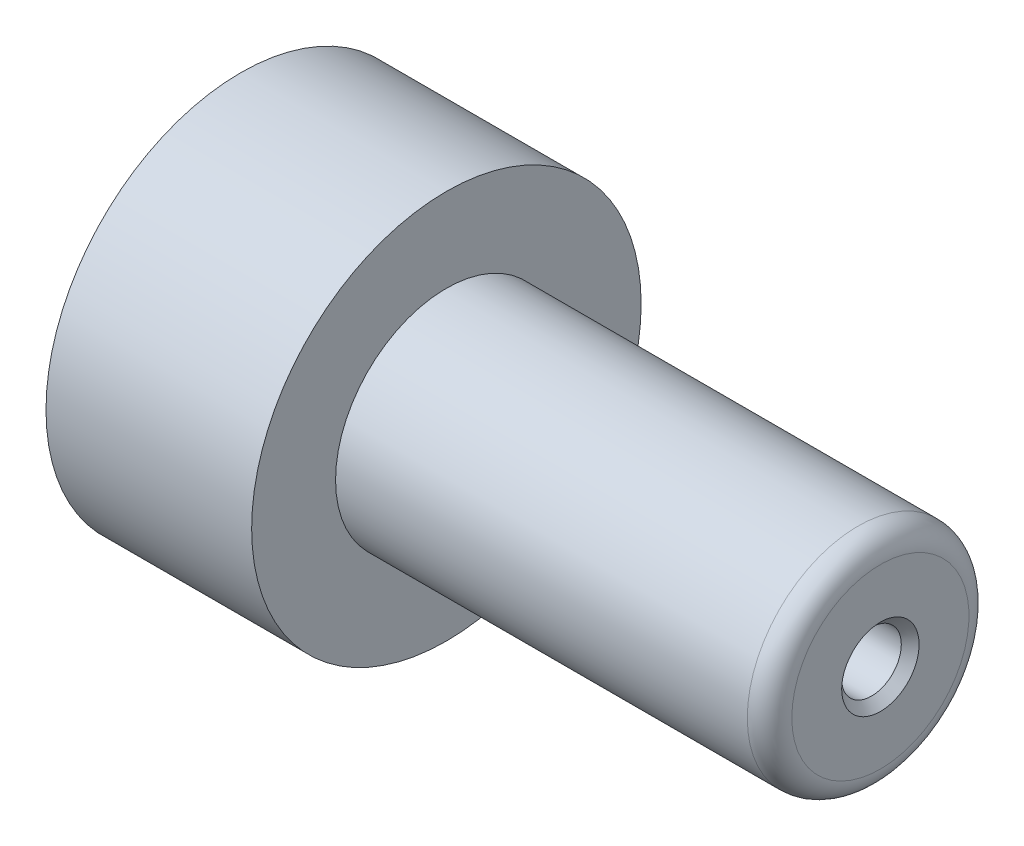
ISO-10303-21;
HEADER;
FILE_DESCRIPTION(('STEP AP214'),'2;1');
FILE_NAME('part.step','',(''),(''),'','','');
FILE_SCHEMA(('AUTOMOTIVE_DESIGN { 1 0 10303 214 1 1 1 1 }'));
ENDSEC;
DATA;
#1=APPLICATION_CONTEXT('core data for automotive mechanical design processes');
#2=APPLICATION_PROTOCOL_DEFINITION('international standard','automotive_design',2000,#1);
#3=PRODUCT_CONTEXT('',#1,'mechanical');
#4=PRODUCT('Part','Part','',(#3));
#5=PRODUCT_RELATED_PRODUCT_CATEGORY('part','',(#4));
#6=PRODUCT_DEFINITION_FORMATION('','',#4);
#7=PRODUCT_DEFINITION_CONTEXT('part definition',#1,'design');
#8=PRODUCT_DEFINITION('design','',#6,#7);
#9=PRODUCT_DEFINITION_SHAPE('','',#8);
#10=(LENGTH_UNIT() NAMED_UNIT(*) SI_UNIT(.MILLI.,.METRE.));
#11=(NAMED_UNIT(*) PLANE_ANGLE_UNIT() SI_UNIT($,.RADIAN.));
#12=(NAMED_UNIT(*) SI_UNIT($,.STERADIAN.) SOLID_ANGLE_UNIT());
#13=UNCERTAINTY_MEASURE_WITH_UNIT(LENGTH_MEASURE(1.E-05),#10,'distance_accuracy_value','');
#14=(GEOMETRIC_REPRESENTATION_CONTEXT(3) GLOBAL_UNCERTAINTY_ASSIGNED_CONTEXT((#13)) GLOBAL_UNIT_ASSIGNED_CONTEXT((#10,
#11,#12)) REPRESENTATION_CONTEXT('',''));
#15=CARTESIAN_POINT('',(0.,0.,0.));
#16=DIRECTION('',(0.,0.,1.));
#17=DIRECTION('',(1.,0.,0.));
#18=AXIS2_PLACEMENT_3D('',#15,#16,#17);
#19=CARTESIAN_POINT('',(0.,0.,0.));
#20=DIRECTION('',(-1.,0.,0.));
#21=DIRECTION('',(0.,0.,1.));
#22=AXIS2_PLACEMENT_3D('',#19,#20,#21);
#23=CYLINDRICAL_SURFACE('',#22,3.9751);
#24=CARTESIAN_POINT('',(21.7678,0.,0.));
#25=DIRECTION('',(-1.,0.,0.));
#26=DIRECTION('',(0.,0.,1.));
#27=AXIS2_PLACEMENT_3D('',#24,#25,#26);
#28=CIRCLE('',#27,3.9751);
#29=CARTESIAN_POINT('',(21.7678,0.,3.9751));
#30=VERTEX_POINT('',#29);
#31=EDGE_CURVE('E44',#30,#30,#28,.T.);
#32=ORIENTED_EDGE('',*,*,#31,.F.);
#33=EDGE_LOOP('',(#32));
#34=FACE_BOUND('',#33,.T.);
#35=CARTESIAN_POINT('',(0.,0.,0.));
#36=DIRECTION('',(-1.,0.,0.));
#37=DIRECTION('',(0.,0.,1.));
#38=AXIS2_PLACEMENT_3D('',#35,#36,#37);
#39=CIRCLE('',#38,3.9751);
#40=CARTESIAN_POINT('',(0.,0.,3.9751));
#41=VERTEX_POINT('',#40);
#42=EDGE_CURVE('E65',#41,#41,#39,.T.);
#43=ORIENTED_EDGE('',*,*,#42,.T.);
#44=EDGE_LOOP('',(#43));
#45=FACE_BOUND('',#44,.T.);
#46=ADVANCED_FACE('F33',(#34,#45),#23,.F.);
#47=CARTESIAN_POINT('',(21.7678,3.9751,0.));
#48=DIRECTION('',(1.,0.,0.));
#49=DIRECTION('',(0.,0.,-1.));
#50=AXIS2_PLACEMENT_3D('',#47,#48,#49);
#51=PLANE('',#50);
#52=ORIENTED_EDGE('',*,*,#31,.T.);
#53=EDGE_LOOP('',(#52));
#54=FACE_BOUND('',#53,.T.);
#55=ADVANCED_FACE('F99',(#54),#51,.F.);
#56=CARTESIAN_POINT('',(36.4998,5.0546,0.));
#57=DIRECTION('',(-1.,0.,0.));
#58=DIRECTION('',(0.,0.,1.));
#59=AXIS2_PLACEMENT_3D('',#56,#57,#58);
#60=PLANE('',#59);
#61=CARTESIAN_POINT('',(36.4998,0.,0.));
#62=DIRECTION('',(-1.,0.,0.));
#63=DIRECTION('',(0.,0.,1.));
#64=AXIS2_PLACEMENT_3D('',#61,#62,#63);
#65=CIRCLE('',#64,2.2098);
#66=CARTESIAN_POINT('',(36.4998,0.,2.2098));
#67=VERTEX_POINT('',#66);
#68=EDGE_CURVE('E10',#67,#67,#65,.T.);
#69=ORIENTED_EDGE('',*,*,#68,.T.);
#70=EDGE_LOOP('',(#69));
#71=FACE_BOUND('',#70,.T.);
#72=CARTESIAN_POINT('',(36.4998,0.,0.));
#73=DIRECTION('',(-1.,0.,0.));
#74=DIRECTION('',(0.,0.,1.));
#75=AXIS2_PLACEMENT_3D('',#72,#73,#74);
#76=CIRCLE('',#75,5.0546);
#77=CARTESIAN_POINT('',(36.4998,0.,5.0546));
#78=VERTEX_POINT('',#77);
#79=EDGE_CURVE('E48',#78,#78,#76,.T.);
#80=ORIENTED_EDGE('',*,*,#79,.F.);
#81=EDGE_LOOP('',(#80));
#82=FACE_BOUND('',#81,.T.);
#83=ADVANCED_FACE('F104',(#71,#82),#60,.F.);
#84=CARTESIAN_POINT('',(35.2298,0.,0.));
#85=DIRECTION('',(-1.,0.,0.));
#86=DIRECTION('',(0.,0.,1.));
#87=AXIS2_PLACEMENT_3D('',#84,#85,#86);
#88=TOROIDAL_SURFACE('',#87,5.0546,1.27);
#89=CARTESIAN_POINT('',(35.2298,0.,0.));
#90=DIRECTION('',(-1.,0.,0.));
#91=DIRECTION('',(0.,0.,1.));
#92=AXIS2_PLACEMENT_3D('',#89,#90,#91);
#93=CIRCLE('',#92,6.3246);
#94=CARTESIAN_POINT('',(35.2298,0.,6.3246));
#95=VERTEX_POINT('',#94);
#96=EDGE_CURVE('E53',#95,#95,#93,.T.);
#97=ORIENTED_EDGE('',*,*,#96,.F.);
#98=EDGE_LOOP('',(#97));
#99=FACE_BOUND('',#98,.T.);
#100=ORIENTED_EDGE('',*,*,#79,.T.);
#101=EDGE_LOOP('',(#100));
#102=FACE_BOUND('',#101,.T.);
#103=ADVANCED_FACE('F112',(#99,#102),#88,.T.);
#104=CARTESIAN_POINT('',(0.,0.,0.));
#105=DIRECTION('',(-1.,0.,0.));
#106=DIRECTION('',(0.,0.,1.));
#107=AXIS2_PLACEMENT_3D('',#104,#105,#106);
#108=CYLINDRICAL_SURFACE('',#107,6.3246);
#109=CARTESIAN_POINT('',(11.7348,0.,0.));
#110=DIRECTION('',(-1.,0.,0.));
#111=DIRECTION('',(0.,0.,1.));
#112=AXIS2_PLACEMENT_3D('',#109,#110,#111);
#113=CIRCLE('',#112,6.3246);
#114=CARTESIAN_POINT('',(11.7348,0.,6.3246));
#115=VERTEX_POINT('',#114);
#116=EDGE_CURVE('E56',#115,#115,#113,.T.);
#117=ORIENTED_EDGE('',*,*,#116,.F.);
#118=EDGE_LOOP('',(#117));
#119=FACE_BOUND('',#118,.T.);
#120=ORIENTED_EDGE('',*,*,#96,.T.);
#121=EDGE_LOOP('',(#120));
#122=FACE_BOUND('',#121,.T.);
#123=ADVANCED_FACE('F115',(#119,#122),#108,.T.);
#124=CARTESIAN_POINT('',(11.7348,11.1125,0.));
#125=DIRECTION('',(-1.,0.,0.));
#126=DIRECTION('',(0.,0.,1.));
#127=AXIS2_PLACEMENT_3D('',#124,#125,#126);
#128=PLANE('',#127);
#129=CARTESIAN_POINT('',(11.7348,0.,0.));
#130=DIRECTION('',(-1.,0.,0.));
#131=DIRECTION('',(0.,0.,1.));
#132=AXIS2_PLACEMENT_3D('',#129,#130,#131);
#133=CIRCLE('',#132,11.1125);
#134=CARTESIAN_POINT('',(11.7348,0.,11.1125));
#135=VERTEX_POINT('',#134);
#136=EDGE_CURVE('E59',#135,#135,#133,.T.);
#137=ORIENTED_EDGE('',*,*,#136,.F.);
#138=EDGE_LOOP('',(#137));
#139=FACE_BOUND('',#138,.T.);
#140=ORIENTED_EDGE('',*,*,#116,.T.);
#141=EDGE_LOOP('',(#140));
#142=FACE_BOUND('',#141,.T.);
#143=ADVANCED_FACE('F119',(#139,#142),#128,.F.);
#144=CARTESIAN_POINT('',(0.,0.,0.));
#145=DIRECTION('',(-1.,0.,0.));
#146=DIRECTION('',(0.,0.,1.));
#147=AXIS2_PLACEMENT_3D('',#144,#145,#146);
#148=CYLINDRICAL_SURFACE('',#147,11.1125);
#149=CARTESIAN_POINT('',(0.,0.,0.));
#150=DIRECTION('',(-1.,0.,0.));
#151=DIRECTION('',(0.,0.,1.));
#152=AXIS2_PLACEMENT_3D('',#149,#150,#151);
#153=CIRCLE('',#152,11.1125);
#154=CARTESIAN_POINT('',(0.,0.,11.1125));
#155=VERTEX_POINT('',#154);
#156=EDGE_CURVE('E62',#155,#155,#153,.T.);
#157=ORIENTED_EDGE('',*,*,#156,.F.);
#158=EDGE_LOOP('',(#157));
#159=FACE_BOUND('',#158,.T.);
#160=ORIENTED_EDGE('',*,*,#136,.T.);
#161=EDGE_LOOP('',(#160));
#162=FACE_BOUND('',#161,.T.);
#163=ADVANCED_FACE('F123',(#159,#162),#148,.T.);
#164=CARTESIAN_POINT('',(0.,3.9751,0.));
#165=DIRECTION('',(1.,0.,0.));
#166=DIRECTION('',(0.,0.,-1.));
#167=AXIS2_PLACEMENT_3D('',#164,#165,#166);
#168=PLANE('',#167);
#169=CARTESIAN_POINT('',(0.,-6.7437,0.));
#170=DIRECTION('',(-1.,0.,0.));
#171=DIRECTION('',(0.,0.,-1.));
#172=AXIS2_PLACEMENT_3D('',#169,#170,#171);
#173=CIRCLE('',#172,1.2065);
#174=CARTESIAN_POINT('',(0.,-6.7437,-1.2065));
#175=VERTEX_POINT('',#174);
#176=EDGE_CURVE('E75',#175,#175,#173,.T.);
#177=ORIENTED_EDGE('',*,*,#176,.F.);
#178=EDGE_LOOP('',(#177));
#179=FACE_BOUND('',#178,.T.);
#180=CARTESIAN_POINT('',(0.,6.7437,0.));
#181=DIRECTION('',(-1.,0.,0.));
#182=DIRECTION('',(0.,0.,1.));
#183=AXIS2_PLACEMENT_3D('',#180,#181,#182);
#184=CIRCLE('',#183,1.2065);
#185=CARTESIAN_POINT('',(0.,6.7437,1.2065));
#186=VERTEX_POINT('',#185);
#187=EDGE_CURVE('E69',#186,#186,#184,.T.);
#188=ORIENTED_EDGE('',*,*,#187,.F.);
#189=EDGE_LOOP('',(#188));
#190=FACE_BOUND('',#189,.T.);
#191=ORIENTED_EDGE('',*,*,#42,.F.);
#192=EDGE_LOOP('',(#191));
#193=FACE_BOUND('',#192,.T.);
#194=ORIENTED_EDGE('',*,*,#156,.T.);
#195=EDGE_LOOP('',(#194));
#196=FACE_BOUND('',#195,.T.);
#197=ADVANCED_FACE('F127',(#179,#190,#193,#196),#168,.F.);
#198=CARTESIAN_POINT('',(2.54,6.7437,0.));
#199=DIRECTION('',(-1.,0.,0.));
#200=DIRECTION('',(0.,0.,1.));
#201=AXIS2_PLACEMENT_3D('',#198,#199,#200);
#202=CYLINDRICAL_SURFACE('',#201,1.2065);
#203=CARTESIAN_POINT('',(2.54,6.7437,0.));
#204=DIRECTION('',(-1.,0.,0.));
#205=DIRECTION('',(0.,0.,1.));
#206=AXIS2_PLACEMENT_3D('',#203,#204,#205);
#207=CIRCLE('',#206,1.2065);
#208=CARTESIAN_POINT('',(2.54,6.7437,1.2065));
#209=VERTEX_POINT('',#208);
#210=EDGE_CURVE('E68',#209,#209,#207,.T.);
#211=ORIENTED_EDGE('',*,*,#210,.F.);
#212=EDGE_LOOP('',(#211));
#213=FACE_BOUND('',#212,.T.);
#214=ORIENTED_EDGE('',*,*,#187,.T.);
#215=EDGE_LOOP('',(#214));
#216=FACE_BOUND('',#215,.T.);
#217=ADVANCED_FACE('F131',(#213,#216),#202,.F.);
#218=CARTESIAN_POINT('',(2.54,6.7437,0.));
#219=DIRECTION('',(-1.,0.,0.));
#220=DIRECTION('',(0.,0.,1.));
#221=AXIS2_PLACEMENT_3D('',#218,#219,#220);
#222=PLANE('',#221);
#223=ORIENTED_EDGE('',*,*,#210,.T.);
#224=EDGE_LOOP('',(#223));
#225=FACE_BOUND('',#224,.T.);
#226=ADVANCED_FACE('F135',(#225),#222,.T.);
#227=CARTESIAN_POINT('',(2.54,-6.7437,0.));
#228=DIRECTION('',(-1.,0.,0.));
#229=DIRECTION('',(0.,0.,1.));
#230=AXIS2_PLACEMENT_3D('',#227,#228,#229);
#231=CYLINDRICAL_SURFACE('',#230,1.2065);
#232=CARTESIAN_POINT('',(2.54,-6.7437,0.));
#233=DIRECTION('',(-1.,0.,0.));
#234=DIRECTION('',(0.,0.,-1.));
#235=AXIS2_PLACEMENT_3D('',#232,#233,#234);
#236=CIRCLE('',#235,1.2065);
#237=CARTESIAN_POINT('',(2.54,-6.7437,-1.2065));
#238=VERTEX_POINT('',#237);
#239=EDGE_CURVE('E72',#238,#238,#236,.T.);
#240=ORIENTED_EDGE('',*,*,#239,.F.);
#241=EDGE_LOOP('',(#240));
#242=FACE_BOUND('',#241,.T.);
#243=ORIENTED_EDGE('',*,*,#176,.T.);
#244=EDGE_LOOP('',(#243));
#245=FACE_BOUND('',#244,.T.);
#246=ADVANCED_FACE('F95',(#242,#245),#231,.F.);
#247=CARTESIAN_POINT('',(2.54,-6.7437,0.));
#248=DIRECTION('',(1.,0.,0.));
#249=DIRECTION('',(0.,0.,-1.));
#250=AXIS2_PLACEMENT_3D('',#247,#248,#249);
#251=PLANE('',#250);
#252=ORIENTED_EDGE('',*,*,#239,.T.);
#253=EDGE_LOOP('',(#252));
#254=FACE_BOUND('',#253,.T.);
#255=ADVANCED_FACE('F88',(#254),#251,.F.);
#256=CARTESIAN_POINT('',(25.4,0.,0.));
#257=DIRECTION('',(1.,0.,0.));
#258=DIRECTION('',(0.,0.,-1.));
#259=AXIS2_PLACEMENT_3D('',#256,#257,#258);
#260=CYLINDRICAL_SURFACE('',#259,1.7018);
#261=CARTESIAN_POINT('',(35.9918,0.,0.));
#262=DIRECTION('',(-1.,0.,0.));
#263=DIRECTION('',(0.,0.,1.));
#264=AXIS2_PLACEMENT_3D('',#261,#262,#263);
#265=CIRCLE('',#264,1.7018);
#266=CARTESIAN_POINT('',(35.9918,0.,1.7018));
#267=VERTEX_POINT('',#266);
#268=EDGE_CURVE('E40',#267,#267,#265,.F.);
#269=ORIENTED_EDGE('',*,*,#268,.T.);
#270=EDGE_LOOP('',(#269));
#271=FACE_BOUND('',#270,.T.);
#272=CARTESIAN_POINT('',(25.4,0.,0.));
#273=DIRECTION('',(1.,0.,0.));
#274=DIRECTION('',(0.,0.,-1.));
#275=AXIS2_PLACEMENT_3D('',#272,#273,#274);
#276=CIRCLE('',#275,1.7018);
#277=CARTESIAN_POINT('',(25.4,0.,-1.7018));
#278=VERTEX_POINT('',#277);
#279=EDGE_CURVE('E78',#278,#278,#276,.T.);
#280=ORIENTED_EDGE('',*,*,#279,.F.);
#281=EDGE_LOOP('',(#280));
#282=FACE_BOUND('',#281,.T.);
#283=ADVANCED_FACE('F86',(#271,#282),#260,.F.);
#284=CARTESIAN_POINT('',(25.4,0.,0.));
#285=DIRECTION('',(1.,0.,0.));
#286=DIRECTION('',(0.,0.,-1.));
#287=AXIS2_PLACEMENT_3D('',#284,#285,#286);
#288=PLANE('',#287);
#289=ORIENTED_EDGE('',*,*,#279,.T.);
#290=EDGE_LOOP('',(#289));
#291=FACE_BOUND('',#290,.T.);
#292=ADVANCED_FACE('F84',(#291),#288,.T.);
#293=CARTESIAN_POINT('',(35.9918,0.,0.));
#294=DIRECTION('',(1.,0.,0.));
#295=DIRECTION('',(0.,0.,-1.));
#296=AXIS2_PLACEMENT_3D('',#293,#294,#295);
#297=CONICAL_SURFACE('',#296,1.7018,0.785398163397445);
#298=ORIENTED_EDGE('',*,*,#68,.F.);
#299=EDGE_LOOP('',(#298));
#300=FACE_BOUND('',#299,.T.);
#301=ORIENTED_EDGE('',*,*,#268,.F.);
#302=EDGE_LOOP('',(#301));
#303=FACE_BOUND('',#302,.T.);
#304=ADVANCED_FACE('F35',(#300,#303),#297,.F.);
#305=CLOSED_SHELL('',(#46,#55,#83,#103,#123,#143,#163,#197,#217,#226,#246,#255,#283,#292,#304));
#306=MANIFOLD_SOLID_BREP('B2',#305);
#307=ADVANCED_BREP_SHAPE_REPRESENTATION('',(#18,#306),#14);
#308=SHAPE_DEFINITION_REPRESENTATION(#9,#307);
ENDSEC;
END-ISO-10303-21;
